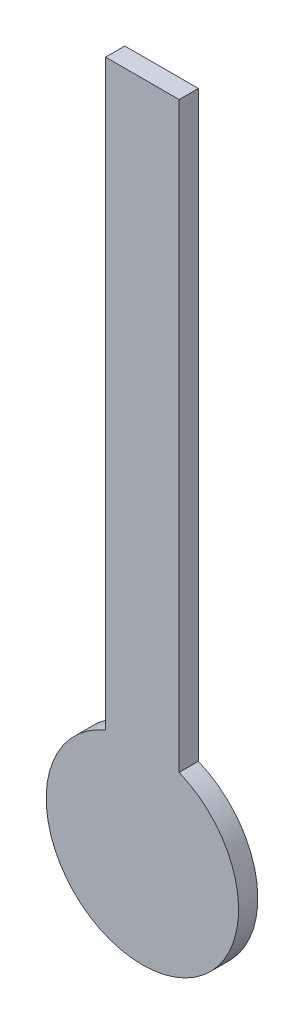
from build123d import *

# Parameters (mm, degrees)
LINEAR_AUSTRAGEN1_DEPTH = 1


with BuildPart() as part:
    # Skizze1 → Linear austragen1 (new body)
    with BuildSketch(Plane.XY):
        with BuildLine():
            Line((-1.91230977, 4.619856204), (-1.91230977, 34.91484721))
            Line((-1.91230977, 34.91484721), (1.909519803, 34.91484721))
            Line((1.909519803, 34.91484721), (1.909519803, 4.621010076))
            ThreePointArc((1.909519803, 4.621010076), (0.001509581, -4.999999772), (-1.91230977, 4.619856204))
        make_face()
    extrude(amount=LINEAR_AUSTRAGEN1_DEPTH)


solid = part.part
